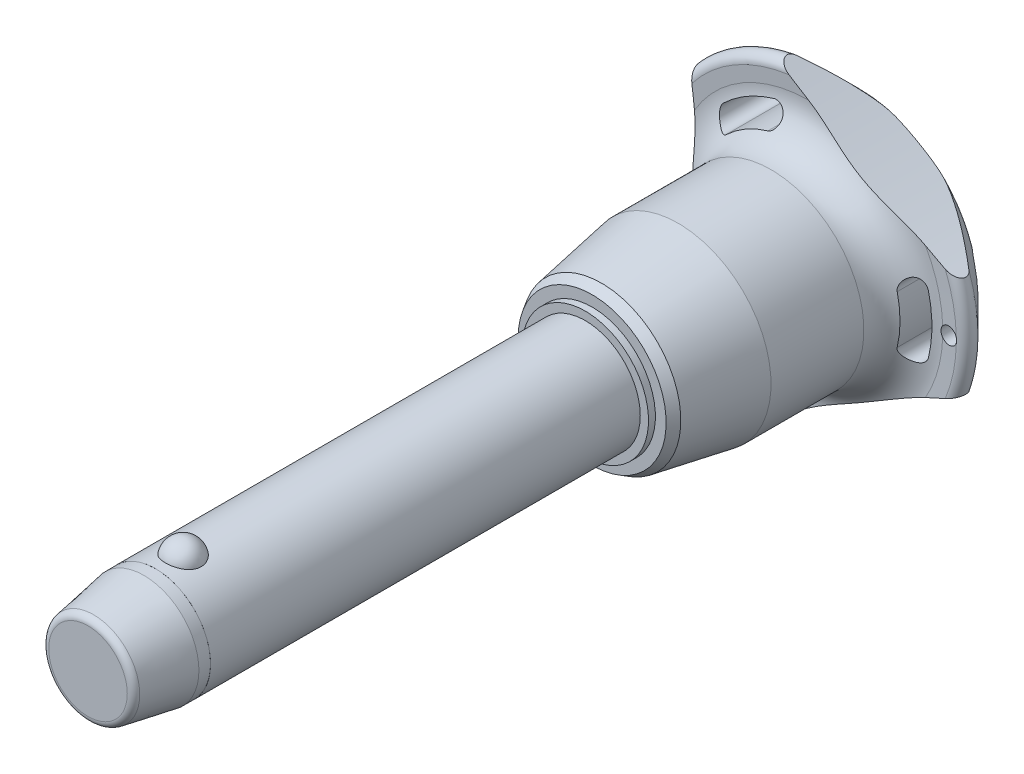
from build123d import *

# Parameters (mm, degrees)
SKETCH1_R           = 10
BOSS_EXTRUDE1_DEPTH = 70
SKETCH2_R           = 8.75
BOSS_EXTRUDE2_DEPTH = 50.7
BOSS_EXTRUDE3_START = 20.5
SKETCH1_2_R         = 10
BOSS_EXTRUDE3_DEPTH = 20.5
CHAMFER1_SIZE       = 10.25
CHAMFER1_SIZE2      = 1.807351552
FILLET1_R           = 1.25
SKETCH6_R           = 176.92625
CUT_EXTRUDE1_DEPTH  = 128.274554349
CIRPATTERN1_COUNT   = 3
SKETCH7_R           = 1.5
CUT_EXTRUDE2_DEPTH  = 128.154892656
SKETCH8_R           = 10
SKETCH8_R_2         = 9.99
CUT_EXTRUDE3_DEPTH  = 12.3


with BuildPart() as part:
    # Sketch1 → Boss-Extrude1 (new body)
    with BuildSketch(Plane.XY):
        Circle(SKETCH1_R)
    extrude(amount=-BOSS_EXTRUDE1_DEPTH)

    # Sketch2 → Boss-Extrude2 (add)
    with BuildSketch(Plane(origin=(0, 0, -70), x_dir=(-1, 0, 0), z_dir=(0, 0, -1))):
        with Locations(Location((0, 0, 0), (0, 0, 180))):
            Circle(SKETCH2_R)
    extrude(amount=BOSS_EXTRUDE2_DEPTH)

    # Sketch3 → Revolve1 (revolve)
    with BuildSketch(Plane(origin=(0, 0, 0), x_dir=(0, 0, -1), z_dir=(1, 0, 0))):
        with BuildLine():
            Line((-3.201562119, 12.5), (-3.201562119, 5.9))
            ThreePointArc((-3.201562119, 5.9), (0.098437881, 9.2), (-3.201562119, 12.5))
        make_face()
        with BuildLine():
            Line((-3.201562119, -5.9), (-3.201562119, -12.5))
            ThreePointArc((-3.201562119, -12.5), (0.098437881, -9.2), (-3.201562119, -5.9))
        make_face()
    revolve(axis=Axis((0, -5.9, 3.201562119), (0, 1, 0)))

    # Sketch1_2 → Boss-Extrude3 (add)
    with BuildSketch(Plane.XY.offset(BOSS_EXTRUDE3_START)):
        Circle(SKETCH1_2_R)
    extrude(amount=-BOSS_EXTRUDE3_DEPTH)

    # Chamfer1
    chamfer1_edges = [part.edges().sort_by_distance(p)[0] for p in [
        (-10, 0, 20.5),
    ]]
    chamfer1_side = [part.faces().sort_by_distance(p)[0] for p in [
        (-10, 0, -24.75),
    ]]
    chamfer(chamfer1_edges, length=CHAMFER1_SIZE, length2=CHAMFER1_SIZE2, reference=chamfer1_side[0])

    # Fillet1
    fillet1_edges = [part.edges().sort_by_distance(p)[0] for p in [
        (-8.192648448, 0, 20.5),
        (-8.75, 0, -120.7),
    ]]
    fillet(fillet1_edges, radius=FILLET1_R)

    # Sketch4 → Revolve2 (revolve)
    with BuildSketch(Plane(origin=(0, 0, 0), x_dir=(0, 0, -1), z_dir=(1, 0, 0)), mode=Mode.PRIVATE) as revolve2_sk:
        Polygon((70, 0), (70, 11.504815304), (71.25, 11.504815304), (71.25, 13.461079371), (72.944174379, 14.439211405), (86.9, 16.9), (103.8, 16.9), (103.8, 0), align=None)
    revolve(revolve2_sk.sketch.rotate(Axis((0, 0, -103.8), (0, 0, 1)), 90), axis=Axis((0, 0, -103.8), (0, 0, 1)))

    # Sketch5 → Revolve3 (revolve)
    with BuildSketch(Plane(origin=(0, 0, 0), x_dir=(0, 0, -1), z_dir=(1, 0, 0)), mode=Mode.PRIVATE) as revolve3_sk:
        with BuildLine():
            Line((110.790129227, 24.271609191), (110.652256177, 26.865060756))
            ThreePointArc((110.652256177, 26.865060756), (111.598671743, 28.411427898), (113.38137085, 28.08137085))
            Line((113.38137085, 28.08137085), (119.763226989, 21.69951471))
            ThreePointArc((119.763226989, 21.69951471), (120.7, 19.381044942), (119.683055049, 17.096604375))
            ThreePointArc((119.683055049, 17.096604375), (114.18864484, 9.321268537), (112.25, 0))
            Line((112.25, 0), (103.8, 0))
            Line((103.8, 0), (103.8, 16.9))
            ThreePointArc((103.8, 16.9), (108.879432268, 19.083427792), (110.790129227, 24.271609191))
        make_face()
    revolve(revolve3_sk.sketch.rotate(Axis((0, 0, -112.25), (0, 0, 1)), 90), axis=Axis((0, 0, -112.25), (0, 0, 1)))

    # Sketch6 → Cut-Extrude1 (cut, through all)
    with BuildSketch(Plane.XY):
        with Locations((-197.42625, 0)):
            Circle(SKETCH6_R)
        with BuildLine():
            ThreePointArc((21.802992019, -5.260839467), (22.428706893, 0), (21.802992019, 5.260839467))
            ThreePointArc((21.802992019, 5.260839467), (19.579234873, 6.620060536), (18.220013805, 4.39630339))
            ThreePointArc((18.220013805, 4.39630339), (18.742902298, 0), (18.220013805, -4.39630339))
            ThreePointArc((18.220013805, -4.39630339), (19.579234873, -6.620060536), (21.802992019, -5.260839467))
        make_face()
    cut_extrude1 = extrude(amount=-CUT_EXTRUDE1_DEPTH, mode=Mode.SUBTRACT)

    # CirPattern1: Cut-Extrude1 ×3 about axis
    cirpattern1_axis = Axis((0, 0, 0), (0, 0, 1))
    for i in range(1, CIRPATTERN1_COUNT):
        add(cut_extrude1.rotate(cirpattern1_axis, i * 360 / CIRPATTERN1_COUNT), mode=Mode.SUBTRACT)

    # Sketch7 → Cut-Extrude2 (cut, through all)
    with BuildSketch(Plane.XY):
        with Locations(Location((25.428706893, 0, 0), (0, 0, 17.230769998))):
            Circle(SKETCH7_R)
    extrude(amount=-CUT_EXTRUDE2_DEPTH, mode=Mode.SUBTRACT)

    # Sketch8 → Cut-Extrude3 (cut)
    with BuildSketch(Plane.XY.offset(20.5)):
        Circle(SKETCH8_R)
        Circle(SKETCH8_R_2, mode=Mode.SUBTRACT)
    extrude(amount=-CUT_EXTRUDE3_DEPTH, mode=Mode.SUBTRACT)


solid = part.part
